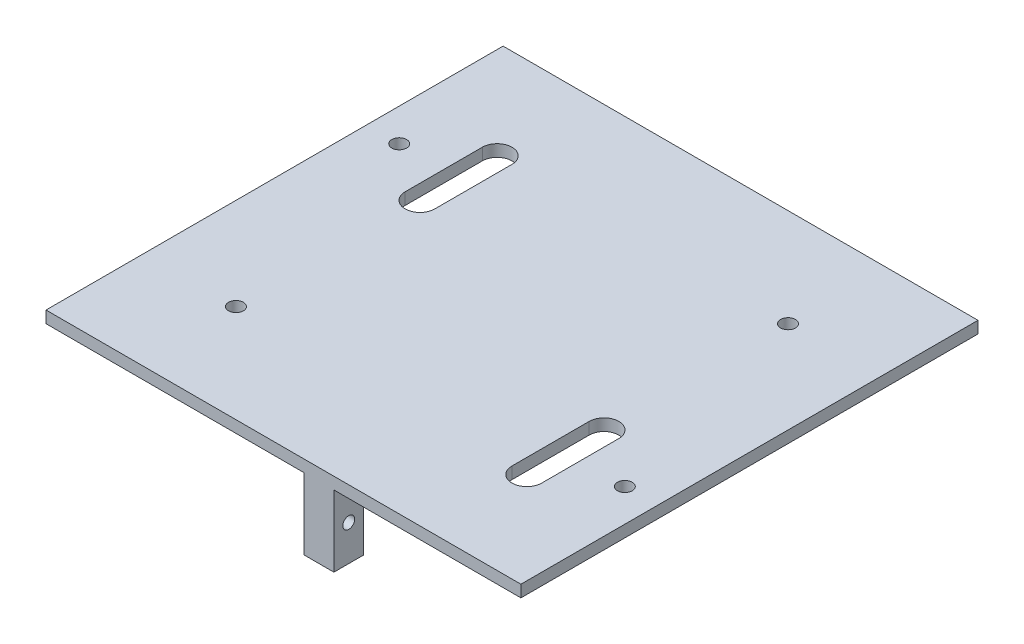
ISO-10303-21;
HEADER;
FILE_DESCRIPTION(('STEP AP214'),'2;1');
FILE_NAME('part.step','',(''),(''),'','','');
FILE_SCHEMA(('AUTOMOTIVE_DESIGN { 1 0 10303 214 1 1 1 1 }'));
ENDSEC;
DATA;
#1=APPLICATION_CONTEXT('core data for automotive mechanical design processes');
#2=APPLICATION_PROTOCOL_DEFINITION('international standard','automotive_design',2000,#1);
#3=PRODUCT_CONTEXT('',#1,'mechanical');
#4=PRODUCT('Part','Part','',(#3));
#5=PRODUCT_RELATED_PRODUCT_CATEGORY('part','',(#4));
#6=PRODUCT_DEFINITION_FORMATION('','',#4);
#7=PRODUCT_DEFINITION_CONTEXT('part definition',#1,'design');
#8=PRODUCT_DEFINITION('design','',#6,#7);
#9=PRODUCT_DEFINITION_SHAPE('','',#8);
#10=(LENGTH_UNIT() NAMED_UNIT(*) SI_UNIT(.MILLI.,.METRE.));
#11=(NAMED_UNIT(*) PLANE_ANGLE_UNIT() SI_UNIT($,.RADIAN.));
#12=(NAMED_UNIT(*) SI_UNIT($,.STERADIAN.) SOLID_ANGLE_UNIT());
#13=UNCERTAINTY_MEASURE_WITH_UNIT(LENGTH_MEASURE(1.E-05),#10,'distance_accuracy_value','');
#14=(GEOMETRIC_REPRESENTATION_CONTEXT(3) GLOBAL_UNCERTAINTY_ASSIGNED_CONTEXT((#13)) GLOBAL_UNIT_ASSIGNED_CONTEXT((#10,
#11,#12)) REPRESENTATION_CONTEXT('',''));
#15=CARTESIAN_POINT('',(0.,0.,0.));
#16=DIRECTION('',(0.,0.,1.));
#17=DIRECTION('',(1.,0.,0.));
#18=AXIS2_PLACEMENT_3D('',#15,#16,#17);
#19=CARTESIAN_POINT('',(0.,0.,0.));
#20=DIRECTION('',(0.,-1.,0.));
#21=DIRECTION('',(0.,0.,-1.));
#22=AXIS2_PLACEMENT_3D('',#19,#20,#21);
#23=PLANE('',#22);
#24=CARTESIAN_POINT('',(24.5,0.,-22.));
#25=DIRECTION('',(0.,-1.,0.));
#26=DIRECTION('',(0.,0.,-1.));
#27=AXIS2_PLACEMENT_3D('',#24,#25,#26);
#28=CIRCLE('',#27,1.25);
#29=CARTESIAN_POINT('',(24.5,0.,-23.25));
#30=VERTEX_POINT('',#29);
#31=EDGE_CURVE('E734',#30,#30,#28,.T.);
#32=ORIENTED_EDGE('',*,*,#31,.F.);
#33=EDGE_LOOP('',(#32));
#34=FACE_BOUND('',#33,.T.);
#35=CARTESIAN_POINT('',(-24.5,0.,22.));
#36=DIRECTION('',(0.,-1.,0.));
#37=DIRECTION('',(0.,0.,-1.));
#38=AXIS2_PLACEMENT_3D('',#35,#36,#37);
#39=CIRCLE('',#38,1.25);
#40=CARTESIAN_POINT('',(-24.5,0.,20.75));
#41=VERTEX_POINT('',#40);
#42=EDGE_CURVE('E743',#41,#41,#39,.T.);
#43=ORIENTED_EDGE('',*,*,#42,.F.);
#44=EDGE_LOOP('',(#43));
#45=FACE_BOUND('',#44,.T.);
#46=CARTESIAN_POINT('',(-34.5,0.,-15.5));
#47=DIRECTION('',(0.,-1.,0.));
#48=DIRECTION('',(0.,0.,-1.));
#49=AXIS2_PLACEMENT_3D('',#46,#47,#48);
#50=CIRCLE('',#49,1.25);
#51=CARTESIAN_POINT('',(-34.5,0.,-16.75));
#52=VERTEX_POINT('',#51);
#53=EDGE_CURVE('E749',#52,#52,#50,.T.);
#54=ORIENTED_EDGE('',*,*,#53,.F.);
#55=EDGE_LOOP('',(#54));
#56=FACE_BOUND('',#55,.T.);
#57=CARTESIAN_POINT('',(34.5,0.,15.5));
#58=DIRECTION('',(0.,-1.,0.));
#59=DIRECTION('',(0.,0.,-1.));
#60=AXIS2_PLACEMENT_3D('',#57,#58,#59);
#61=CIRCLE('',#60,1.25);
#62=CARTESIAN_POINT('',(34.5,0.,14.25));
#63=VERTEX_POINT('',#62);
#64=EDGE_CURVE('E740',#63,#63,#61,.T.);
#65=ORIENTED_EDGE('',*,*,#64,.F.);
#66=EDGE_LOOP('',(#65));
#67=FACE_BOUND('',#66,.T.);
#68=DIRECTION('',(0.,0.,1.));
#69=VECTOR('',#68,1.);
#70=CARTESIAN_POINT('',(3.5,0.,33.5));
#71=LINE('',#70,#69);
#72=CARTESIAN_POINT('',(3.5,0.,33.5));
#73=VERTEX_POINT('',#72);
#74=CARTESIAN_POINT('',(3.5,0.,38.5));
#75=VERTEX_POINT('',#74);
#76=EDGE_CURVE('E240',#73,#75,#71,.T.);
#77=ORIENTED_EDGE('',*,*,#76,.T.);
#78=DIRECTION('',(1.,0.,0.));
#79=VECTOR('',#78,1.);
#80=CARTESIAN_POINT('',(-40.,0.,38.5));
#81=LINE('',#80,#79);
#82=CARTESIAN_POINT('',(-40.,0.,38.5));
#83=VERTEX_POINT('',#82);
#84=EDGE_CURVE('E505',#83,#75,#81,.T.);
#85=ORIENTED_EDGE('',*,*,#84,.F.);
#86=DIRECTION('',(0.,0.,1.));
#87=VECTOR('',#86,1.);
#88=CARTESIAN_POINT('',(-40.,0.,-38.5));
#89=LINE('',#88,#87);
#90=CARTESIAN_POINT('',(-40.,0.,-38.5));
#91=VERTEX_POINT('',#90);
#92=EDGE_CURVE('E486',#91,#83,#89,.T.);
#93=ORIENTED_EDGE('',*,*,#92,.F.);
#94=DIRECTION('',(1.,0.,0.));
#95=VECTOR('',#94,1.);
#96=CARTESIAN_POINT('',(-40.,0.,-38.5));
#97=LINE('',#96,#95);
#98=CARTESIAN_POINT('',(-8.5,0.,-38.5));
#99=VERTEX_POINT('',#98);
#100=EDGE_CURVE('E497',#91,#99,#97,.T.);
#101=ORIENTED_EDGE('',*,*,#100,.T.);
#102=DIRECTION('',(0.,0.,1.));
#103=VECTOR('',#102,1.);
#104=CARTESIAN_POINT('',(-8.5,0.,-38.5));
#105=LINE('',#104,#103);
#106=CARTESIAN_POINT('',(-8.5,0.,-33.5));
#107=VERTEX_POINT('',#106);
#108=EDGE_CURVE('E340',#99,#107,#105,.T.);
#109=ORIENTED_EDGE('',*,*,#108,.T.);
#110=DIRECTION('',(1.,0.,0.));
#111=VECTOR('',#110,1.);
#112=CARTESIAN_POINT('',(-8.5,0.,-33.5));
#113=LINE('',#112,#111);
#114=CARTESIAN_POINT('',(-3.5,0.,-33.5));
#115=VERTEX_POINT('',#114);
#116=EDGE_CURVE('E371',#107,#115,#113,.T.);
#117=ORIENTED_EDGE('',*,*,#116,.T.);
#118=DIRECTION('',(0.,0.,1.));
#119=VECTOR('',#118,1.);
#120=CARTESIAN_POINT('',(-3.5,0.,-38.5));
#121=LINE('',#120,#119);
#122=CARTESIAN_POINT('',(-3.5,0.,-38.5));
#123=VERTEX_POINT('',#122);
#124=EDGE_CURVE('E358',#123,#115,#121,.T.);
#125=ORIENTED_EDGE('',*,*,#124,.F.);
#126=CARTESIAN_POINT('',(40.,0.,-38.5));
#127=VERTEX_POINT('',#126);
#128=EDGE_CURVE('E438',#123,#127,#97,.T.);
#129=ORIENTED_EDGE('',*,*,#128,.T.);
#130=DIRECTION('',(0.,0.,1.));
#131=VECTOR('',#130,1.);
#132=CARTESIAN_POINT('',(40.,0.,-38.5));
#133=LINE('',#132,#131);
#134=CARTESIAN_POINT('',(40.,0.,38.5));
#135=VERTEX_POINT('',#134);
#136=EDGE_CURVE('E500',#127,#135,#133,.T.);
#137=ORIENTED_EDGE('',*,*,#136,.T.);
#138=CARTESIAN_POINT('',(8.5,0.,38.5));
#139=VERTEX_POINT('',#138);
#140=EDGE_CURVE('E504',#139,#135,#81,.T.);
#141=ORIENTED_EDGE('',*,*,#140,.F.);
#142=DIRECTION('',(0.,0.,1.));
#143=VECTOR('',#142,1.);
#144=CARTESIAN_POINT('',(8.5,0.,33.5));
#145=LINE('',#144,#143);
#146=CARTESIAN_POINT('',(8.5,0.,33.5));
#147=VERTEX_POINT('',#146);
#148=EDGE_CURVE('E56',#147,#139,#145,.T.);
#149=ORIENTED_EDGE('',*,*,#148,.F.);
#150=DIRECTION('',(1.,0.,0.));
#151=VECTOR('',#150,1.);
#152=CARTESIAN_POINT('',(3.5,0.,33.5));
#153=LINE('',#152,#151);
#154=EDGE_CURVE('E231',#73,#147,#153,.T.);
#155=ORIENTED_EDGE('',*,*,#154,.F.);
#156=EDGE_LOOP('',(#77,#85,#93,#101,#109,#117,#125,#129,#137,#141,#149,#155));
#157=FACE_BOUND('',#156,.T.);
#158=DIRECTION('',(0.,0.,1.));
#159=VECTOR('',#158,1.);
#160=CARTESIAN_POINT('',(3.5,0.,5.));
#161=LINE('',#160,#159);
#162=CARTESIAN_POINT('',(3.5,0.,5.));
#163=VERTEX_POINT('',#162);
#164=CARTESIAN_POINT('',(3.5,0.,10.));
#165=VERTEX_POINT('',#164);
#166=EDGE_CURVE('E293',#163,#165,#161,.T.);
#167=ORIENTED_EDGE('',*,*,#166,.T.);
#168=DIRECTION('',(1.,0.,0.));
#169=VECTOR('',#168,1.);
#170=CARTESIAN_POINT('',(3.5,0.,10.));
#171=LINE('',#170,#169);
#172=CARTESIAN_POINT('',(8.5,0.,10.));
#173=VERTEX_POINT('',#172);
#174=EDGE_CURVE('E290',#165,#173,#171,.T.);
#175=ORIENTED_EDGE('',*,*,#174,.T.);
#176=DIRECTION('',(0.,0.,1.));
#177=VECTOR('',#176,1.);
#178=CARTESIAN_POINT('',(8.5,0.,5.));
#179=LINE('',#178,#177);
#180=CARTESIAN_POINT('',(8.5,0.,5.));
#181=VERTEX_POINT('',#180);
#182=EDGE_CURVE('E285',#181,#173,#179,.T.);
#183=ORIENTED_EDGE('',*,*,#182,.F.);
#184=DIRECTION('',(1.,0.,0.));
#185=VECTOR('',#184,1.);
#186=CARTESIAN_POINT('',(3.5,0.,5.));
#187=LINE('',#186,#185);
#188=EDGE_CURVE('E64',#163,#181,#187,.T.);
#189=ORIENTED_EDGE('',*,*,#188,.F.);
#190=EDGE_LOOP('',(#167,#175,#183,#189));
#191=FACE_BOUND('',#190,.T.);
#192=DIRECTION('',(0.,0.,1.));
#193=VECTOR('',#192,1.);
#194=CARTESIAN_POINT('',(-8.50000000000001,0.,-10.));
#195=LINE('',#194,#193);
#196=CARTESIAN_POINT('',(-8.50000000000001,0.,-10.));
#197=VERTEX_POINT('',#196);
#198=CARTESIAN_POINT('',(-8.50000000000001,0.,-5.));
#199=VERTEX_POINT('',#198);
#200=EDGE_CURVE('E337',#197,#199,#195,.T.);
#201=ORIENTED_EDGE('',*,*,#200,.T.);
#202=DIRECTION('',(1.,0.,0.));
#203=VECTOR('',#202,1.);
#204=CARTESIAN_POINT('',(-8.50000000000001,0.,-5.));
#205=LINE('',#204,#203);
#206=CARTESIAN_POINT('',(-3.50000000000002,0.,-5.));
#207=VERTEX_POINT('',#206);
#208=EDGE_CURVE('E334',#199,#207,#205,.T.);
#209=ORIENTED_EDGE('',*,*,#208,.T.);
#210=DIRECTION('',(0.,0.,1.));
#211=VECTOR('',#210,1.);
#212=CARTESIAN_POINT('',(-3.50000000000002,0.,-10.));
#213=LINE('',#212,#211);
#214=CARTESIAN_POINT('',(-3.50000000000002,0.,-10.));
#215=VERTEX_POINT('',#214);
#216=EDGE_CURVE('E329',#215,#207,#213,.T.);
#217=ORIENTED_EDGE('',*,*,#216,.F.);
#218=DIRECTION('',(1.,0.,0.));
#219=VECTOR('',#218,1.);
#220=CARTESIAN_POINT('',(-8.50000000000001,0.,-10.));
#221=LINE('',#220,#219);
#222=EDGE_CURVE('E325',#197,#215,#221,.T.);
#223=ORIENTED_EDGE('',*,*,#222,.F.);
#224=EDGE_LOOP('',(#201,#209,#217,#223));
#225=FACE_BOUND('',#224,.T.);
#226=DIRECTION('',(0.,0.,1.));
#227=VECTOR('',#226,1.);
#228=CARTESIAN_POINT('',(27.,0.,9.));
#229=LINE('',#228,#227);
#230=CARTESIAN_POINT('',(27.,0.,9.));
#231=VERTEX_POINT('',#230);
#232=CARTESIAN_POINT('',(27.,0.,22.));
#233=VERTEX_POINT('',#232);
#234=EDGE_CURVE('E453',#231,#233,#229,.T.);
#235=ORIENTED_EDGE('',*,*,#234,.F.);
#236=CARTESIAN_POINT('',(24.5,0.,9.));
#237=DIRECTION('',(0.,1.,0.));
#238=DIRECTION('',(0.,0.,1.));
#239=AXIS2_PLACEMENT_3D('',#236,#237,#238);
#240=CIRCLE('',#239,2.49999999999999);
#241=CARTESIAN_POINT('',(22.,0.,9.));
#242=VERTEX_POINT('',#241);
#243=EDGE_CURVE('E414',#231,#242,#240,.T.);
#244=ORIENTED_EDGE('',*,*,#243,.T.);
#245=DIRECTION('',(0.,0.,1.));
#246=VECTOR('',#245,1.);
#247=CARTESIAN_POINT('',(22.,0.,9.));
#248=LINE('',#247,#246);
#249=CARTESIAN_POINT('',(22.,0.,22.));
#250=VERTEX_POINT('',#249);
#251=EDGE_CURVE('E462',#242,#250,#248,.T.);
#252=ORIENTED_EDGE('',*,*,#251,.T.);
#253=CARTESIAN_POINT('',(24.5,0.,22.));
#254=DIRECTION('',(0.,1.,0.));
#255=DIRECTION('',(0.,0.,1.));
#256=AXIS2_PLACEMENT_3D('',#253,#254,#255);
#257=CIRCLE('',#256,2.49999999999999);
#258=EDGE_CURVE('E457',#250,#233,#257,.T.);
#259=ORIENTED_EDGE('',*,*,#258,.T.);
#260=EDGE_LOOP('',(#235,#244,#252,#259));
#261=FACE_BOUND('',#260,.T.);
#262=DIRECTION('',(0.,0.,-1.));
#263=VECTOR('',#262,1.);
#264=CARTESIAN_POINT('',(-27.,0.,-9.));
#265=LINE('',#264,#263);
#266=CARTESIAN_POINT('',(-27.,0.,-9.));
#267=VERTEX_POINT('',#266);
#268=CARTESIAN_POINT('',(-27.,0.,-22.));
#269=VERTEX_POINT('',#268);
#270=EDGE_CURVE('E397',#267,#269,#265,.T.);
#271=ORIENTED_EDGE('',*,*,#270,.F.);
#272=CARTESIAN_POINT('',(-24.5,0.,-9.));
#273=DIRECTION('',(0.,1.,0.));
#274=DIRECTION('',(0.,0.,1.));
#275=AXIS2_PLACEMENT_3D('',#272,#273,#274);
#276=CIRCLE('',#275,2.5);
#277=CARTESIAN_POINT('',(-22.,0.,-9.));
#278=VERTEX_POINT('',#277);
#279=EDGE_CURVE('E409',#267,#278,#276,.T.);
#280=ORIENTED_EDGE('',*,*,#279,.T.);
#281=DIRECTION('',(0.,0.,-1.));
#282=VECTOR('',#281,1.);
#283=CARTESIAN_POINT('',(-22.,0.,-9.));
#284=LINE('',#283,#282);
#285=CARTESIAN_POINT('',(-22.,0.,-22.));
#286=VERTEX_POINT('',#285);
#287=EDGE_CURVE('E413',#278,#286,#284,.T.);
#288=ORIENTED_EDGE('',*,*,#287,.T.);
#289=CARTESIAN_POINT('',(-24.5,0.,-22.));
#290=DIRECTION('',(0.,1.,0.));
#291=DIRECTION('',(0.,0.,1.));
#292=AXIS2_PLACEMENT_3D('',#289,#290,#291);
#293=CIRCLE('',#292,2.5);
#294=EDGE_CURVE('E418',#286,#269,#293,.T.);
#295=ORIENTED_EDGE('',*,*,#294,.T.);
#296=EDGE_LOOP('',(#271,#280,#288,#295));
#297=FACE_BOUND('',#296,.T.);
#298=ADVANCED_FACE('F38',(#34,#45,#56,#67,#157,#191,#225,#261,#297),#23,.T.);
#299=CARTESIAN_POINT('',(0.,2.,0.));
#300=DIRECTION('',(0.,-1.,0.));
#301=DIRECTION('',(0.,0.,-1.));
#302=AXIS2_PLACEMENT_3D('',#299,#300,#301);
#303=PLANE('',#302);
#304=CARTESIAN_POINT('',(24.5,2.,-22.));
#305=DIRECTION('',(0.,-1.,0.));
#306=DIRECTION('',(0.,0.,-1.));
#307=AXIS2_PLACEMENT_3D('',#304,#305,#306);
#308=CIRCLE('',#307,1.25);
#309=CARTESIAN_POINT('',(24.5,2.,-23.25));
#310=VERTEX_POINT('',#309);
#311=EDGE_CURVE('E732',#310,#310,#308,.F.);
#312=ORIENTED_EDGE('',*,*,#311,.F.);
#313=EDGE_LOOP('',(#312));
#314=FACE_BOUND('',#313,.T.);
#315=CARTESIAN_POINT('',(-24.5,2.,22.));
#316=DIRECTION('',(0.,-1.,0.));
#317=DIRECTION('',(0.,0.,-1.));
#318=AXIS2_PLACEMENT_3D('',#315,#316,#317);
#319=CIRCLE('',#318,1.25);
#320=CARTESIAN_POINT('',(-24.5,2.,20.75));
#321=VERTEX_POINT('',#320);
#322=EDGE_CURVE('E736',#321,#321,#319,.F.);
#323=ORIENTED_EDGE('',*,*,#322,.F.);
#324=EDGE_LOOP('',(#323));
#325=FACE_BOUND('',#324,.T.);
#326=CARTESIAN_POINT('',(-34.5,2.,-15.5));
#327=DIRECTION('',(0.,-1.,0.));
#328=DIRECTION('',(0.,0.,-1.));
#329=AXIS2_PLACEMENT_3D('',#326,#327,#328);
#330=CIRCLE('',#329,1.25);
#331=CARTESIAN_POINT('',(-34.5,2.,-16.75));
#332=VERTEX_POINT('',#331);
#333=EDGE_CURVE('E753',#332,#332,#330,.F.);
#334=ORIENTED_EDGE('',*,*,#333,.F.);
#335=EDGE_LOOP('',(#334));
#336=FACE_BOUND('',#335,.T.);
#337=CARTESIAN_POINT('',(34.5,2.,15.5));
#338=DIRECTION('',(0.,-1.,0.));
#339=DIRECTION('',(0.,0.,-1.));
#340=AXIS2_PLACEMENT_3D('',#337,#338,#339);
#341=CIRCLE('',#340,1.25);
#342=CARTESIAN_POINT('',(34.5,2.,14.25));
#343=VERTEX_POINT('',#342);
#344=EDGE_CURVE('E754',#343,#343,#341,.F.);
#345=ORIENTED_EDGE('',*,*,#344,.F.);
#346=EDGE_LOOP('',(#345));
#347=FACE_BOUND('',#346,.T.);
#348=CARTESIAN_POINT('',(24.5,2.,9.));
#349=DIRECTION('',(0.,1.,0.));
#350=DIRECTION('',(0.,0.,1.));
#351=AXIS2_PLACEMENT_3D('',#348,#349,#350);
#352=CIRCLE('',#351,2.49999999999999);
#353=CARTESIAN_POINT('',(27.,2.,9.));
#354=VERTEX_POINT('',#353);
#355=CARTESIAN_POINT('',(22.,2.,9.));
#356=VERTEX_POINT('',#355);
#357=EDGE_CURVE('E458',#354,#356,#352,.T.);
#358=ORIENTED_EDGE('',*,*,#357,.F.);
#359=DIRECTION('',(0.,0.,1.));
#360=VECTOR('',#359,1.);
#361=CARTESIAN_POINT('',(27.,2.,9.));
#362=LINE('',#361,#360);
#363=CARTESIAN_POINT('',(27.,2.,22.));
#364=VERTEX_POINT('',#363);
#365=EDGE_CURVE('E452',#354,#364,#362,.T.);
#366=ORIENTED_EDGE('',*,*,#365,.T.);
#367=CARTESIAN_POINT('',(24.5,2.,22.));
#368=DIRECTION('',(0.,1.,0.));
#369=DIRECTION('',(0.,0.,1.));
#370=AXIS2_PLACEMENT_3D('',#367,#368,#369);
#371=CIRCLE('',#370,2.49999999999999);
#372=CARTESIAN_POINT('',(22.,2.,22.));
#373=VERTEX_POINT('',#372);
#374=EDGE_CURVE('E472',#373,#364,#371,.T.);
#375=ORIENTED_EDGE('',*,*,#374,.F.);
#376=DIRECTION('',(0.,0.,1.));
#377=VECTOR('',#376,1.);
#378=CARTESIAN_POINT('',(22.,2.,9.));
#379=LINE('',#378,#377);
#380=EDGE_CURVE('E476',#356,#373,#379,.T.);
#381=ORIENTED_EDGE('',*,*,#380,.F.);
#382=EDGE_LOOP('',(#358,#366,#375,#381));
#383=FACE_BOUND('',#382,.T.);
#384=DIRECTION('',(1.,0.,0.));
#385=VECTOR('',#384,1.);
#386=CARTESIAN_POINT('',(-40.,2.,-38.5));
#387=LINE('',#386,#385);
#388=CARTESIAN_POINT('',(-40.,2.,-38.5));
#389=VERTEX_POINT('',#388);
#390=CARTESIAN_POINT('',(40.,2.,-38.5));
#391=VERTEX_POINT('',#390);
#392=EDGE_CURVE('E481',#389,#391,#387,.T.);
#393=ORIENTED_EDGE('',*,*,#392,.F.);
#394=DIRECTION('',(0.,0.,1.));
#395=VECTOR('',#394,1.);
#396=CARTESIAN_POINT('',(-40.,2.,-38.5));
#397=LINE('',#396,#395);
#398=CARTESIAN_POINT('',(-40.,2.,38.5));
#399=VERTEX_POINT('',#398);
#400=EDGE_CURVE('E493',#389,#399,#397,.T.);
#401=ORIENTED_EDGE('',*,*,#400,.T.);
#402=DIRECTION('',(1.,0.,0.));
#403=VECTOR('',#402,1.);
#404=CARTESIAN_POINT('',(-40.,2.,38.5));
#405=LINE('',#404,#403);
#406=CARTESIAN_POINT('',(40.,2.,38.5));
#407=VERTEX_POINT('',#406);
#408=EDGE_CURVE('E490',#399,#407,#405,.T.);
#409=ORIENTED_EDGE('',*,*,#408,.T.);
#410=DIRECTION('',(0.,0.,1.));
#411=VECTOR('',#410,1.);
#412=CARTESIAN_POINT('',(40.,2.,-38.5));
#413=LINE('',#412,#411);
#414=EDGE_CURVE('E485',#391,#407,#413,.T.);
#415=ORIENTED_EDGE('',*,*,#414,.F.);
#416=EDGE_LOOP('',(#393,#401,#409,#415));
#417=FACE_BOUND('',#416,.T.);
#418=CARTESIAN_POINT('',(-24.5,2.,-9.));
#419=DIRECTION('',(0.,1.,0.));
#420=DIRECTION('',(0.,0.,1.));
#421=AXIS2_PLACEMENT_3D('',#418,#419,#420);
#422=CIRCLE('',#421,2.5);
#423=CARTESIAN_POINT('',(-27.,2.,-9.));
#424=VERTEX_POINT('',#423);
#425=CARTESIAN_POINT('',(-22.,2.,-9.));
#426=VERTEX_POINT('',#425);
#427=EDGE_CURVE('E393',#424,#426,#422,.T.);
#428=ORIENTED_EDGE('',*,*,#427,.F.);
#429=DIRECTION('',(0.,0.,-1.));
#430=VECTOR('',#429,1.);
#431=CARTESIAN_POINT('',(-27.,2.,-9.));
#432=LINE('',#431,#430);
#433=CARTESIAN_POINT('',(-27.,2.,-22.));
#434=VERTEX_POINT('',#433);
#435=EDGE_CURVE('E404',#424,#434,#432,.T.);
#436=ORIENTED_EDGE('',*,*,#435,.T.);
#437=CARTESIAN_POINT('',(-24.5,2.,-22.));
#438=DIRECTION('',(0.,1.,0.));
#439=DIRECTION('',(0.,0.,1.));
#440=AXIS2_PLACEMENT_3D('',#437,#438,#439);
#441=CIRCLE('',#440,2.5);
#442=CARTESIAN_POINT('',(-22.,2.,-22.));
#443=VERTEX_POINT('',#442);
#444=EDGE_CURVE('E400',#443,#434,#441,.T.);
#445=ORIENTED_EDGE('',*,*,#444,.F.);
#446=DIRECTION('',(0.,0.,-1.));
#447=VECTOR('',#446,1.);
#448=CARTESIAN_POINT('',(-22.,2.,-9.));
#449=LINE('',#448,#447);
#450=EDGE_CURVE('E396',#426,#443,#449,.T.);
#451=ORIENTED_EDGE('',*,*,#450,.F.);
#452=EDGE_LOOP('',(#428,#436,#445,#451));
#453=FACE_BOUND('',#452,.T.);
#454=ADVANCED_FACE('F582',(#314,#325,#336,#347,#383,#417,#453),#303,.F.);
#455=CARTESIAN_POINT('',(-40.,2.,-38.5));
#456=DIRECTION('',(0.,0.,-1.));
#457=DIRECTION('',(-1.,0.,0.));
#458=AXIS2_PLACEMENT_3D('',#455,#456,#457);
#459=PLANE('',#458);
#460=ORIENTED_EDGE('',*,*,#100,.F.);
#461=DIRECTION('',(0.,-1.,0.));
#462=VECTOR('',#461,1.);
#463=CARTESIAN_POINT('',(-40.,2.,-38.5));
#464=LINE('',#463,#462);
#465=EDGE_CURVE('E11',#389,#91,#464,.T.);
#466=ORIENTED_EDGE('',*,*,#465,.F.);
#467=ORIENTED_EDGE('',*,*,#392,.T.);
#468=DIRECTION('',(0.,-1.,0.));
#469=VECTOR('',#468,1.);
#470=CARTESIAN_POINT('',(40.,2.,-38.5));
#471=LINE('',#470,#469);
#472=EDGE_CURVE('E496',#391,#127,#471,.T.);
#473=ORIENTED_EDGE('',*,*,#472,.T.);
#474=ORIENTED_EDGE('',*,*,#128,.F.);
#475=DIRECTION('',(0.,1.,0.));
#476=VECTOR('',#475,1.);
#477=CARTESIAN_POINT('',(-3.5,-12.,-38.5));
#478=LINE('',#477,#476);
#479=CARTESIAN_POINT('',(-3.5,-12.,-38.5));
#480=VERTEX_POINT('',#479);
#481=EDGE_CURVE('E382',#480,#123,#478,.T.);
#482=ORIENTED_EDGE('',*,*,#481,.F.);
#483=DIRECTION('',(1.,0.,0.));
#484=VECTOR('',#483,1.);
#485=CARTESIAN_POINT('',(-8.5,-12.,-38.5));
#486=LINE('',#485,#484);
#487=CARTESIAN_POINT('',(-8.5,-12.,-38.5));
#488=VERTEX_POINT('',#487);
#489=EDGE_CURVE('E365',#488,#480,#486,.T.);
#490=ORIENTED_EDGE('',*,*,#489,.F.);
#491=DIRECTION('',(0.,1.,0.));
#492=VECTOR('',#491,1.);
#493=CARTESIAN_POINT('',(-8.5,-12.,-38.5));
#494=LINE('',#493,#492);
#495=EDGE_CURVE('E377',#488,#99,#494,.T.);
#496=ORIENTED_EDGE('',*,*,#495,.T.);
#497=EDGE_LOOP('',(#460,#466,#467,#473,#474,#482,#490,#496));
#498=FACE_BOUND('',#497,.T.);
#499=ADVANCED_FACE('F40',(#498),#459,.T.);
#500=CARTESIAN_POINT('',(-40.,2.,-38.5));
#501=DIRECTION('',(1.,0.,0.));
#502=DIRECTION('',(0.,0.,-1.));
#503=AXIS2_PLACEMENT_3D('',#500,#501,#502);
#504=PLANE('',#503);
#505=ORIENTED_EDGE('',*,*,#92,.T.);
#506=DIRECTION('',(0.,-1.,0.));
#507=VECTOR('',#506,1.);
#508=CARTESIAN_POINT('',(-40.,2.,38.5));
#509=LINE('',#508,#507);
#510=EDGE_CURVE('E48',#399,#83,#509,.T.);
#511=ORIENTED_EDGE('',*,*,#510,.F.);
#512=ORIENTED_EDGE('',*,*,#400,.F.);
#513=ORIENTED_EDGE('',*,*,#465,.T.);
#514=EDGE_LOOP('',(#505,#511,#512,#513));
#515=FACE_BOUND('',#514,.T.);
#516=ADVANCED_FACE('F584',(#515),#504,.F.);
#517=CARTESIAN_POINT('',(-40.,2.,38.5));
#518=DIRECTION('',(0.,0.,-1.));
#519=DIRECTION('',(-1.,0.,0.));
#520=AXIS2_PLACEMENT_3D('',#517,#518,#519);
#521=PLANE('',#520);
#522=ORIENTED_EDGE('',*,*,#84,.T.);
#523=DIRECTION('',(0.,1.,0.));
#524=VECTOR('',#523,1.);
#525=CARTESIAN_POINT('',(3.5,-12.,38.5));
#526=LINE('',#525,#524);
#527=CARTESIAN_POINT('',(3.5,-12.,38.5));
#528=VERTEX_POINT('',#527);
#529=EDGE_CURVE('E242',#528,#75,#526,.T.);
#530=ORIENTED_EDGE('',*,*,#529,.F.);
#531=DIRECTION('',(1.,0.,0.));
#532=VECTOR('',#531,1.);
#533=CARTESIAN_POINT('',(3.5,-12.,38.5));
#534=LINE('',#533,#532);
#535=CARTESIAN_POINT('',(8.5,-12.,38.5));
#536=VERTEX_POINT('',#535);
#537=EDGE_CURVE('E256',#528,#536,#534,.T.);
#538=ORIENTED_EDGE('',*,*,#537,.T.);
#539=DIRECTION('',(0.,1.,0.));
#540=VECTOR('',#539,1.);
#541=CARTESIAN_POINT('',(8.5,-12.,38.5));
#542=LINE('',#541,#540);
#543=EDGE_CURVE('E541',#536,#139,#542,.T.);
#544=ORIENTED_EDGE('',*,*,#543,.T.);
#545=ORIENTED_EDGE('',*,*,#140,.T.);
#546=DIRECTION('',(0.,-1.,0.));
#547=VECTOR('',#546,1.);
#548=CARTESIAN_POINT('',(40.,2.,38.5));
#549=LINE('',#548,#547);
#550=EDGE_CURVE('E513',#407,#135,#549,.T.);
#551=ORIENTED_EDGE('',*,*,#550,.F.);
#552=ORIENTED_EDGE('',*,*,#408,.F.);
#553=ORIENTED_EDGE('',*,*,#510,.T.);
#554=EDGE_LOOP('',(#522,#530,#538,#544,#545,#551,#552,#553));
#555=FACE_BOUND('',#554,.T.);
#556=ADVANCED_FACE('F550',(#555),#521,.F.);
#557=CARTESIAN_POINT('',(40.,2.,-38.5));
#558=DIRECTION('',(1.,0.,0.));
#559=DIRECTION('',(0.,0.,-1.));
#560=AXIS2_PLACEMENT_3D('',#557,#558,#559);
#561=PLANE('',#560);
#562=ORIENTED_EDGE('',*,*,#136,.F.);
#563=ORIENTED_EDGE('',*,*,#472,.F.);
#564=ORIENTED_EDGE('',*,*,#414,.T.);
#565=ORIENTED_EDGE('',*,*,#550,.T.);
#566=EDGE_LOOP('',(#562,#563,#564,#565));
#567=FACE_BOUND('',#566,.T.);
#568=ADVANCED_FACE('F578',(#567),#561,.T.);
#569=CARTESIAN_POINT('',(24.5,2.,9.));
#570=DIRECTION('',(0.,-1.,0.));
#571=DIRECTION('',(0.,0.,-1.));
#572=AXIS2_PLACEMENT_3D('',#569,#570,#571);
#573=CYLINDRICAL_SURFACE('',#572,2.49999999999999);
#574=ORIENTED_EDGE('',*,*,#243,.F.);
#575=DIRECTION('',(0.,-1.,0.));
#576=VECTOR('',#575,1.);
#577=CARTESIAN_POINT('',(27.,2.,9.));
#578=LINE('',#577,#576);
#579=EDGE_CURVE('E448',#354,#231,#578,.T.);
#580=ORIENTED_EDGE('',*,*,#579,.F.);
#581=ORIENTED_EDGE('',*,*,#357,.T.);
#582=DIRECTION('',(0.,-1.,0.));
#583=VECTOR('',#582,1.);
#584=CARTESIAN_POINT('',(22.,2.,9.));
#585=LINE('',#584,#583);
#586=EDGE_CURVE('E381',#356,#242,#585,.T.);
#587=ORIENTED_EDGE('',*,*,#586,.T.);
#588=EDGE_LOOP('',(#574,#580,#581,#587));
#589=FACE_BOUND('',#588,.T.);
#590=ADVANCED_FACE('F616',(#589),#573,.F.);
#591=CARTESIAN_POINT('',(22.,2.,9.));
#592=DIRECTION('',(1.,0.,0.));
#593=DIRECTION('',(0.,0.,-1.));
#594=AXIS2_PLACEMENT_3D('',#591,#592,#593);
#595=PLANE('',#594);
#596=ORIENTED_EDGE('',*,*,#251,.F.);
#597=ORIENTED_EDGE('',*,*,#586,.F.);
#598=ORIENTED_EDGE('',*,*,#380,.T.);
#599=DIRECTION('',(0.,-1.,0.));
#600=VECTOR('',#599,1.);
#601=CARTESIAN_POINT('',(22.,2.,22.));
#602=LINE('',#601,#600);
#603=EDGE_CURVE('E442',#373,#250,#602,.T.);
#604=ORIENTED_EDGE('',*,*,#603,.T.);
#605=EDGE_LOOP('',(#596,#597,#598,#604));
#606=FACE_BOUND('',#605,.T.);
#607=ADVANCED_FACE('F612',(#606),#595,.T.);
#608=CARTESIAN_POINT('',(24.5,2.,22.));
#609=DIRECTION('',(0.,-1.,0.));
#610=DIRECTION('',(0.,0.,-1.));
#611=AXIS2_PLACEMENT_3D('',#608,#609,#610);
#612=CYLINDRICAL_SURFACE('',#611,2.49999999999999);
#613=ORIENTED_EDGE('',*,*,#258,.F.);
#614=ORIENTED_EDGE('',*,*,#603,.F.);
#615=ORIENTED_EDGE('',*,*,#374,.T.);
#616=DIRECTION('',(0.,-1.,0.));
#617=VECTOR('',#616,1.);
#618=CARTESIAN_POINT('',(27.,2.,22.));
#619=LINE('',#618,#617);
#620=EDGE_CURVE('E445',#364,#233,#619,.T.);
#621=ORIENTED_EDGE('',*,*,#620,.T.);
#622=EDGE_LOOP('',(#613,#614,#615,#621));
#623=FACE_BOUND('',#622,.T.);
#624=ADVANCED_FACE('F608',(#623),#612,.F.);
#625=CARTESIAN_POINT('',(27.,2.,9.));
#626=DIRECTION('',(1.,0.,0.));
#627=DIRECTION('',(0.,0.,-1.));
#628=AXIS2_PLACEMENT_3D('',#625,#626,#627);
#629=PLANE('',#628);
#630=ORIENTED_EDGE('',*,*,#234,.T.);
#631=ORIENTED_EDGE('',*,*,#620,.F.);
#632=ORIENTED_EDGE('',*,*,#365,.F.);
#633=ORIENTED_EDGE('',*,*,#579,.T.);
#634=EDGE_LOOP('',(#630,#631,#632,#633));
#635=FACE_BOUND('',#634,.T.);
#636=ADVANCED_FACE('F604',(#635),#629,.F.);
#637=CARTESIAN_POINT('',(-24.5,2.,-9.));
#638=DIRECTION('',(0.,-1.,0.));
#639=DIRECTION('',(0.,0.,-1.));
#640=AXIS2_PLACEMENT_3D('',#637,#638,#639);
#641=CYLINDRICAL_SURFACE('',#640,2.5);
#642=ORIENTED_EDGE('',*,*,#279,.F.);
#643=DIRECTION('',(0.,-1.,0.));
#644=VECTOR('',#643,1.);
#645=CARTESIAN_POINT('',(-27.,2.,-9.));
#646=LINE('',#645,#644);
#647=EDGE_CURVE('E408',#424,#267,#646,.T.);
#648=ORIENTED_EDGE('',*,*,#647,.F.);
#649=ORIENTED_EDGE('',*,*,#427,.T.);
#650=DIRECTION('',(0.,-1.,0.));
#651=VECTOR('',#650,1.);
#652=CARTESIAN_POINT('',(-22.,2.,-9.));
#653=LINE('',#652,#651);
#654=EDGE_CURVE('E434',#426,#278,#653,.T.);
#655=ORIENTED_EDGE('',*,*,#654,.T.);
#656=EDGE_LOOP('',(#642,#648,#649,#655));
#657=FACE_BOUND('',#656,.T.);
#658=ADVANCED_FACE('F607',(#657),#641,.F.);
#659=CARTESIAN_POINT('',(-22.,2.,-9.));
#660=DIRECTION('',(-1.,0.,0.));
#661=DIRECTION('',(0.,0.,1.));
#662=AXIS2_PLACEMENT_3D('',#659,#660,#661);
#663=PLANE('',#662);
#664=ORIENTED_EDGE('',*,*,#287,.F.);
#665=ORIENTED_EDGE('',*,*,#654,.F.);
#666=ORIENTED_EDGE('',*,*,#450,.T.);
#667=DIRECTION('',(0.,-1.,0.));
#668=VECTOR('',#667,1.);
#669=CARTESIAN_POINT('',(-22.,2.,-22.));
#670=LINE('',#669,#668);
#671=EDGE_CURVE('E431',#443,#286,#670,.T.);
#672=ORIENTED_EDGE('',*,*,#671,.T.);
#673=EDGE_LOOP('',(#664,#665,#666,#672));
#674=FACE_BOUND('',#673,.T.);
#675=ADVANCED_FACE('F623',(#674),#663,.T.);
#676=CARTESIAN_POINT('',(-24.5,2.,-22.));
#677=DIRECTION('',(0.,-1.,0.));
#678=DIRECTION('',(0.,0.,-1.));
#679=AXIS2_PLACEMENT_3D('',#676,#677,#678);
#680=CYLINDRICAL_SURFACE('',#679,2.5);
#681=ORIENTED_EDGE('',*,*,#294,.F.);
#682=ORIENTED_EDGE('',*,*,#671,.F.);
#683=ORIENTED_EDGE('',*,*,#444,.T.);
#684=DIRECTION('',(0.,-1.,0.));
#685=VECTOR('',#684,1.);
#686=CARTESIAN_POINT('',(-27.,2.,-22.));
#687=LINE('',#686,#685);
#688=EDGE_CURVE('E428',#434,#269,#687,.T.);
#689=ORIENTED_EDGE('',*,*,#688,.T.);
#690=EDGE_LOOP('',(#681,#682,#683,#689));
#691=FACE_BOUND('',#690,.T.);
#692=ADVANCED_FACE('F627',(#691),#680,.F.);
#693=CARTESIAN_POINT('',(-27.,2.,-9.));
#694=DIRECTION('',(-1.,0.,0.));
#695=DIRECTION('',(0.,0.,1.));
#696=AXIS2_PLACEMENT_3D('',#693,#694,#695);
#697=PLANE('',#696);
#698=ORIENTED_EDGE('',*,*,#270,.T.);
#699=ORIENTED_EDGE('',*,*,#688,.F.);
#700=ORIENTED_EDGE('',*,*,#435,.F.);
#701=ORIENTED_EDGE('',*,*,#647,.T.);
#702=EDGE_LOOP('',(#698,#699,#700,#701));
#703=FACE_BOUND('',#702,.T.);
#704=ADVANCED_FACE('F631',(#703),#697,.F.);
#705=CARTESIAN_POINT('',(-8.5,-12.,-38.5));
#706=DIRECTION('',(-1.,0.,0.));
#707=DIRECTION('',(0.,0.,1.));
#708=AXIS2_PLACEMENT_3D('',#705,#706,#707);
#709=PLANE('',#708);
#710=CARTESIAN_POINT('',(-8.50000000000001,-6.,-36.));
#711=DIRECTION('',(-1.,0.,0.));
#712=DIRECTION('',(0.,0.,1.));
#713=AXIS2_PLACEMENT_3D('',#710,#711,#712);
#714=CIRCLE('',#713,0.999999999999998);
#715=CARTESIAN_POINT('',(-8.50000000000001,-6.,-35.));
#716=VERTEX_POINT('',#715);
#717=EDGE_CURVE('E769',#716,#716,#714,.T.);
#718=ORIENTED_EDGE('',*,*,#717,.F.);
#719=EDGE_LOOP('',(#718));
#720=FACE_BOUND('',#719,.T.);
#721=ORIENTED_EDGE('',*,*,#108,.F.);
#722=ORIENTED_EDGE('',*,*,#495,.F.);
#723=DIRECTION('',(0.,0.,1.));
#724=VECTOR('',#723,1.);
#725=CARTESIAN_POINT('',(-8.5,-12.,-38.5));
#726=LINE('',#725,#724);
#727=CARTESIAN_POINT('',(-8.5,-12.,-33.5));
#728=VERTEX_POINT('',#727);
#729=EDGE_CURVE('E353',#488,#728,#726,.T.);
#730=ORIENTED_EDGE('',*,*,#729,.T.);
#731=DIRECTION('',(0.,1.,0.));
#732=VECTOR('',#731,1.);
#733=CARTESIAN_POINT('',(-8.5,-12.,-33.5));
#734=LINE('',#733,#732);
#735=EDGE_CURVE('E368',#728,#107,#734,.T.);
#736=ORIENTED_EDGE('',*,*,#735,.T.);
#737=EDGE_LOOP('',(#721,#722,#730,#736));
#738=FACE_BOUND('',#737,.T.);
#739=ADVANCED_FACE('F563',(#720,#738),#709,.T.);
#740=CARTESIAN_POINT('',(-3.5,-12.,-38.5));
#741=DIRECTION('',(-1.,0.,0.));
#742=DIRECTION('',(0.,0.,1.));
#743=AXIS2_PLACEMENT_3D('',#740,#741,#742);
#744=PLANE('',#743);
#745=CARTESIAN_POINT('',(-3.5,-6.,-36.));
#746=DIRECTION('',(-1.,0.,0.));
#747=DIRECTION('',(0.,0.,1.));
#748=AXIS2_PLACEMENT_3D('',#745,#746,#747);
#749=CIRCLE('',#748,0.999999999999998);
#750=CARTESIAN_POINT('',(-3.5,-6.,-35.));
#751=VERTEX_POINT('',#750);
#752=EDGE_CURVE('E42',#751,#751,#749,.T.);
#753=ORIENTED_EDGE('',*,*,#752,.T.);
#754=EDGE_LOOP('',(#753));
#755=FACE_BOUND('',#754,.T.);
#756=ORIENTED_EDGE('',*,*,#124,.T.);
#757=DIRECTION('',(0.,1.,0.));
#758=VECTOR('',#757,1.);
#759=CARTESIAN_POINT('',(-3.5,-12.,-33.5));
#760=LINE('',#759,#758);
#761=CARTESIAN_POINT('',(-3.5,-12.,-33.5));
#762=VERTEX_POINT('',#761);
#763=EDGE_CURVE('E386',#762,#115,#760,.T.);
#764=ORIENTED_EDGE('',*,*,#763,.F.);
#765=DIRECTION('',(0.,0.,1.));
#766=VECTOR('',#765,1.);
#767=CARTESIAN_POINT('',(-3.5,-12.,-38.5));
#768=LINE('',#767,#766);
#769=EDGE_CURVE('E362',#480,#762,#768,.T.);
#770=ORIENTED_EDGE('',*,*,#769,.F.);
#771=ORIENTED_EDGE('',*,*,#481,.T.);
#772=EDGE_LOOP('',(#756,#764,#770,#771));
#773=FACE_BOUND('',#772,.T.);
#774=ADVANCED_FACE('F572',(#755,#773),#744,.F.);
#775=CARTESIAN_POINT('',(-8.5,-12.,-33.5));
#776=DIRECTION('',(0.,0.,1.));
#777=DIRECTION('',(1.,0.,0.));
#778=AXIS2_PLACEMENT_3D('',#775,#776,#777);
#779=PLANE('',#778);
#780=ORIENTED_EDGE('',*,*,#116,.F.);
#781=ORIENTED_EDGE('',*,*,#735,.F.);
#782=DIRECTION('',(1.,0.,0.));
#783=VECTOR('',#782,1.);
#784=CARTESIAN_POINT('',(-8.5,-12.,-33.5));
#785=LINE('',#784,#783);
#786=EDGE_CURVE('E357',#728,#762,#785,.T.);
#787=ORIENTED_EDGE('',*,*,#786,.T.);
#788=ORIENTED_EDGE('',*,*,#763,.T.);
#789=EDGE_LOOP('',(#780,#781,#787,#788));
#790=FACE_BOUND('',#789,.T.);
#791=ADVANCED_FACE('F568',(#790),#779,.T.);
#792=CARTESIAN_POINT('',(0.,-12.,0.));
#793=DIRECTION('',(0.,1.,0.));
#794=DIRECTION('',(0.,0.,1.));
#795=AXIS2_PLACEMENT_3D('',#792,#793,#794);
#796=PLANE('',#795);
#797=ORIENTED_EDGE('',*,*,#729,.F.);
#798=ORIENTED_EDGE('',*,*,#489,.T.);
#799=ORIENTED_EDGE('',*,*,#769,.T.);
#800=ORIENTED_EDGE('',*,*,#786,.F.);
#801=EDGE_LOOP('',(#797,#798,#799,#800));
#802=FACE_BOUND('',#801,.T.);
#803=ADVANCED_FACE('F641',(#802),#796,.F.);
#804=CARTESIAN_POINT('',(-8.50000000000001,-12.,-10.));
#805=DIRECTION('',(-1.,0.,0.));
#806=DIRECTION('',(0.,0.,1.));
#807=AXIS2_PLACEMENT_3D('',#804,#805,#806);
#808=PLANE('',#807);
#809=CARTESIAN_POINT('',(-8.50000000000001,-6.,-7.5));
#810=DIRECTION('',(-1.,0.,0.));
#811=DIRECTION('',(0.,0.,1.));
#812=AXIS2_PLACEMENT_3D('',#809,#810,#811);
#813=CIRCLE('',#812,1.);
#814=CARTESIAN_POINT('',(-8.50000000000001,-6.,-6.5));
#815=VERTEX_POINT('',#814);
#816=EDGE_CURVE('E535',#815,#815,#813,.T.);
#817=ORIENTED_EDGE('',*,*,#816,.F.);
#818=EDGE_LOOP('',(#817));
#819=FACE_BOUND('',#818,.T.);
#820=ORIENTED_EDGE('',*,*,#200,.F.);
#821=DIRECTION('',(0.,1.,0.));
#822=VECTOR('',#821,1.);
#823=CARTESIAN_POINT('',(-8.50000000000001,-12.,-10.));
#824=LINE('',#823,#822);
#825=CARTESIAN_POINT('',(-8.50000000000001,-12.,-10.));
#826=VERTEX_POINT('',#825);
#827=EDGE_CURVE('E296',#826,#197,#824,.T.);
#828=ORIENTED_EDGE('',*,*,#827,.F.);
#829=DIRECTION('',(0.,0.,1.));
#830=VECTOR('',#829,1.);
#831=CARTESIAN_POINT('',(-8.50000000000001,-12.,-10.));
#832=LINE('',#831,#830);
#833=CARTESIAN_POINT('',(-8.50000000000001,-12.,-5.));
#834=VERTEX_POINT('',#833);
#835=EDGE_CURVE('E330',#826,#834,#832,.T.);
#836=ORIENTED_EDGE('',*,*,#835,.T.);
#837=DIRECTION('',(0.,1.,0.));
#838=VECTOR('',#837,1.);
#839=CARTESIAN_POINT('',(-8.50000000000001,-12.,-5.));
#840=LINE('',#839,#838);
#841=EDGE_CURVE('E309',#834,#199,#840,.T.);
#842=ORIENTED_EDGE('',*,*,#841,.T.);
#843=EDGE_LOOP('',(#820,#828,#836,#842));
#844=FACE_BOUND('',#843,.T.);
#845=ADVANCED_FACE('F647',(#819,#844),#808,.T.);
#846=CARTESIAN_POINT('',(-8.50000000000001,-12.,-10.));
#847=DIRECTION('',(0.,0.,1.));
#848=DIRECTION('',(1.,0.,0.));
#849=AXIS2_PLACEMENT_3D('',#846,#847,#848);
#850=PLANE('',#849);
#851=ORIENTED_EDGE('',*,*,#222,.T.);
#852=DIRECTION('',(0.,1.,0.));
#853=VECTOR('',#852,1.);
#854=CARTESIAN_POINT('',(-3.50000000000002,-12.,-10.));
#855=LINE('',#854,#853);
#856=CARTESIAN_POINT('',(-3.50000000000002,-12.,-10.));
#857=VERTEX_POINT('',#856);
#858=EDGE_CURVE('E318',#857,#215,#855,.T.);
#859=ORIENTED_EDGE('',*,*,#858,.F.);
#860=DIRECTION('',(1.,0.,0.));
#861=VECTOR('',#860,1.);
#862=CARTESIAN_POINT('',(-8.50000000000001,-12.,-10.));
#863=LINE('',#862,#861);
#864=EDGE_CURVE('E313',#826,#857,#863,.T.);
#865=ORIENTED_EDGE('',*,*,#864,.F.);
#866=ORIENTED_EDGE('',*,*,#827,.T.);
#867=EDGE_LOOP('',(#851,#859,#865,#866));
#868=FACE_BOUND('',#867,.T.);
#869=ADVANCED_FACE('F655',(#868),#850,.F.);
#870=CARTESIAN_POINT('',(-3.50000000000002,-12.,-10.));
#871=DIRECTION('',(-1.,0.,0.));
#872=DIRECTION('',(0.,0.,1.));
#873=AXIS2_PLACEMENT_3D('',#870,#871,#872);
#874=PLANE('',#873);
#875=CARTESIAN_POINT('',(-3.50000000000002,-6.,-7.5));
#876=DIRECTION('',(-1.,0.,0.));
#877=DIRECTION('',(0.,0.,1.));
#878=AXIS2_PLACEMENT_3D('',#875,#876,#877);
#879=CIRCLE('',#878,1.);
#880=CARTESIAN_POINT('',(-3.50000000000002,-6.,-6.5));
#881=VERTEX_POINT('',#880);
#882=EDGE_CURVE('E519',#881,#881,#879,.T.);
#883=ORIENTED_EDGE('',*,*,#882,.T.);
#884=EDGE_LOOP('',(#883));
#885=FACE_BOUND('',#884,.T.);
#886=ORIENTED_EDGE('',*,*,#216,.T.);
#887=DIRECTION('',(0.,1.,0.));
#888=VECTOR('',#887,1.);
#889=CARTESIAN_POINT('',(-3.50000000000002,-12.,-5.));
#890=LINE('',#889,#888);
#891=CARTESIAN_POINT('',(-3.50000000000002,-12.,-5.));
#892=VERTEX_POINT('',#891);
#893=EDGE_CURVE('E314',#892,#207,#890,.T.);
#894=ORIENTED_EDGE('',*,*,#893,.F.);
#895=DIRECTION('',(0.,0.,1.));
#896=VECTOR('',#895,1.);
#897=CARTESIAN_POINT('',(-3.50000000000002,-12.,-10.));
#898=LINE('',#897,#896);
#899=EDGE_CURVE('E343',#857,#892,#898,.T.);
#900=ORIENTED_EDGE('',*,*,#899,.F.);
#901=ORIENTED_EDGE('',*,*,#858,.T.);
#902=EDGE_LOOP('',(#886,#894,#900,#901));
#903=FACE_BOUND('',#902,.T.);
#904=ADVANCED_FACE('F658',(#885,#903),#874,.F.);
#905=CARTESIAN_POINT('',(-8.50000000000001,-12.,-5.));
#906=DIRECTION('',(0.,0.,1.));
#907=DIRECTION('',(1.,0.,0.));
#908=AXIS2_PLACEMENT_3D('',#905,#906,#907);
#909=PLANE('',#908);
#910=ORIENTED_EDGE('',*,*,#208,.F.);
#911=ORIENTED_EDGE('',*,*,#841,.F.);
#912=DIRECTION('',(1.,0.,0.));
#913=VECTOR('',#912,1.);
#914=CARTESIAN_POINT('',(-8.50000000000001,-12.,-5.));
#915=LINE('',#914,#913);
#916=EDGE_CURVE('E346',#834,#892,#915,.T.);
#917=ORIENTED_EDGE('',*,*,#916,.T.);
#918=ORIENTED_EDGE('',*,*,#893,.T.);
#919=EDGE_LOOP('',(#910,#911,#917,#918));
#920=FACE_BOUND('',#919,.T.);
#921=ADVANCED_FACE('F653',(#920),#909,.T.);
#922=CARTESIAN_POINT('',(0.,-12.,0.));
#923=DIRECTION('',(0.,1.,0.));
#924=DIRECTION('',(0.,0.,1.));
#925=AXIS2_PLACEMENT_3D('',#922,#923,#924);
#926=PLANE('',#925);
#927=ORIENTED_EDGE('',*,*,#835,.F.);
#928=ORIENTED_EDGE('',*,*,#864,.T.);
#929=ORIENTED_EDGE('',*,*,#899,.T.);
#930=ORIENTED_EDGE('',*,*,#916,.F.);
#931=EDGE_LOOP('',(#927,#928,#929,#930));
#932=FACE_BOUND('',#931,.T.);
#933=ADVANCED_FACE('F649',(#932),#926,.F.);
#934=CARTESIAN_POINT('',(3.5,-12.,5.));
#935=DIRECTION('',(-1.,0.,0.));
#936=DIRECTION('',(0.,0.,1.));
#937=AXIS2_PLACEMENT_3D('',#934,#935,#936);
#938=PLANE('',#937);
#939=CARTESIAN_POINT('',(3.5,-6.,7.5));
#940=DIRECTION('',(-1.,0.,0.));
#941=DIRECTION('',(0.,0.,1.));
#942=AXIS2_PLACEMENT_3D('',#939,#940,#941);
#943=CIRCLE('',#942,1.);
#944=CARTESIAN_POINT('',(3.5,-6.,8.5));
#945=VERTEX_POINT('',#944);
#946=EDGE_CURVE('E522',#945,#945,#943,.T.);
#947=ORIENTED_EDGE('',*,*,#946,.F.);
#948=EDGE_LOOP('',(#947));
#949=FACE_BOUND('',#948,.T.);
#950=ORIENTED_EDGE('',*,*,#166,.F.);
#951=DIRECTION('',(0.,1.,0.));
#952=VECTOR('',#951,1.);
#953=CARTESIAN_POINT('',(3.5,-12.,5.));
#954=LINE('',#953,#952);
#955=CARTESIAN_POINT('',(3.5,-12.,5.));
#956=VERTEX_POINT('',#955);
#957=EDGE_CURVE('E247',#956,#163,#954,.T.);
#958=ORIENTED_EDGE('',*,*,#957,.F.);
#959=DIRECTION('',(0.,0.,1.));
#960=VECTOR('',#959,1.);
#961=CARTESIAN_POINT('',(3.5,-12.,5.));
#962=LINE('',#961,#960);
#963=CARTESIAN_POINT('',(3.5,-12.,10.));
#964=VERTEX_POINT('',#963);
#965=EDGE_CURVE('E286',#956,#964,#962,.T.);
#966=ORIENTED_EDGE('',*,*,#965,.T.);
#967=DIRECTION('',(0.,1.,0.));
#968=VECTOR('',#967,1.);
#969=CARTESIAN_POINT('',(3.5,-12.,10.));
#970=LINE('',#969,#968);
#971=EDGE_CURVE('E268',#964,#165,#970,.T.);
#972=ORIENTED_EDGE('',*,*,#971,.T.);
#973=EDGE_LOOP('',(#950,#958,#966,#972));
#974=FACE_BOUND('',#973,.T.);
#975=ADVANCED_FACE('F652',(#949,#974),#938,.T.);
#976=CARTESIAN_POINT('',(3.5,-12.,5.));
#977=DIRECTION('',(0.,0.,1.));
#978=DIRECTION('',(1.,0.,0.));
#979=AXIS2_PLACEMENT_3D('',#976,#977,#978);
#980=PLANE('',#979);
#981=ORIENTED_EDGE('',*,*,#188,.T.);
#982=DIRECTION('',(0.,1.,0.));
#983=VECTOR('',#982,1.);
#984=CARTESIAN_POINT('',(8.5,-12.,5.));
#985=LINE('',#984,#983);
#986=CARTESIAN_POINT('',(8.5,-12.,5.));
#987=VERTEX_POINT('',#986);
#988=EDGE_CURVE('E277',#987,#181,#985,.T.);
#989=ORIENTED_EDGE('',*,*,#988,.F.);
#990=DIRECTION('',(1.,0.,0.));
#991=VECTOR('',#990,1.);
#992=CARTESIAN_POINT('',(3.5,-12.,5.));
#993=LINE('',#992,#991);
#994=EDGE_CURVE('E272',#956,#987,#993,.T.);
#995=ORIENTED_EDGE('',*,*,#994,.F.);
#996=ORIENTED_EDGE('',*,*,#957,.T.);
#997=EDGE_LOOP('',(#981,#989,#995,#996));
#998=FACE_BOUND('',#997,.T.);
#999=ADVANCED_FACE('F673',(#998),#980,.F.);
#1000=CARTESIAN_POINT('',(8.5,-12.,5.));
#1001=DIRECTION('',(-1.,0.,0.));
#1002=DIRECTION('',(0.,0.,1.));
#1003=AXIS2_PLACEMENT_3D('',#1000,#1001,#1002);
#1004=PLANE('',#1003);
#1005=CARTESIAN_POINT('',(8.49999999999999,-6.,7.5));
#1006=DIRECTION('',(-1.,0.,0.));
#1007=DIRECTION('',(0.,0.,1.));
#1008=AXIS2_PLACEMENT_3D('',#1005,#1006,#1007);
#1009=CIRCLE('',#1008,1.);
#1010=CARTESIAN_POINT('',(8.49999999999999,-6.,8.5));
#1011=VERTEX_POINT('',#1010);
#1012=EDGE_CURVE('E765',#1011,#1011,#1009,.F.);
#1013=ORIENTED_EDGE('',*,*,#1012,.F.);
#1014=EDGE_LOOP('',(#1013));
#1015=FACE_BOUND('',#1014,.T.);
#1016=ORIENTED_EDGE('',*,*,#182,.T.);
#1017=DIRECTION('',(0.,1.,0.));
#1018=VECTOR('',#1017,1.);
#1019=CARTESIAN_POINT('',(8.5,-12.,10.));
#1020=LINE('',#1019,#1018);
#1021=CARTESIAN_POINT('',(8.5,-12.,10.));
#1022=VERTEX_POINT('',#1021);
#1023=EDGE_CURVE('E273',#1022,#173,#1020,.T.);
#1024=ORIENTED_EDGE('',*,*,#1023,.F.);
#1025=DIRECTION('',(0.,0.,1.));
#1026=VECTOR('',#1025,1.);
#1027=CARTESIAN_POINT('',(8.5,-12.,5.));
#1028=LINE('',#1027,#1026);
#1029=EDGE_CURVE('E299',#987,#1022,#1028,.T.);
#1030=ORIENTED_EDGE('',*,*,#1029,.F.);
#1031=ORIENTED_EDGE('',*,*,#988,.T.);
#1032=EDGE_LOOP('',(#1016,#1024,#1030,#1031));
#1033=FACE_BOUND('',#1032,.T.);
#1034=ADVANCED_FACE('F676',(#1015,#1033),#1004,.F.);
#1035=CARTESIAN_POINT('',(3.5,-12.,10.));
#1036=DIRECTION('',(0.,0.,1.));
#1037=DIRECTION('',(1.,0.,0.));
#1038=AXIS2_PLACEMENT_3D('',#1035,#1036,#1037);
#1039=PLANE('',#1038);
#1040=ORIENTED_EDGE('',*,*,#174,.F.);
#1041=ORIENTED_EDGE('',*,*,#971,.F.);
#1042=DIRECTION('',(1.,0.,0.));
#1043=VECTOR('',#1042,1.);
#1044=CARTESIAN_POINT('',(3.5,-12.,10.));
#1045=LINE('',#1044,#1043);
#1046=EDGE_CURVE('E302',#964,#1022,#1045,.T.);
#1047=ORIENTED_EDGE('',*,*,#1046,.T.);
#1048=ORIENTED_EDGE('',*,*,#1023,.T.);
#1049=EDGE_LOOP('',(#1040,#1041,#1047,#1048));
#1050=FACE_BOUND('',#1049,.T.);
#1051=ADVANCED_FACE('F671',(#1050),#1039,.T.);
#1052=CARTESIAN_POINT('',(0.,-12.,0.));
#1053=DIRECTION('',(0.,1.,0.));
#1054=DIRECTION('',(0.,0.,1.));
#1055=AXIS2_PLACEMENT_3D('',#1052,#1053,#1054);
#1056=PLANE('',#1055);
#1057=ORIENTED_EDGE('',*,*,#965,.F.);
#1058=ORIENTED_EDGE('',*,*,#994,.T.);
#1059=ORIENTED_EDGE('',*,*,#1029,.T.);
#1060=ORIENTED_EDGE('',*,*,#1046,.F.);
#1061=EDGE_LOOP('',(#1057,#1058,#1059,#1060));
#1062=FACE_BOUND('',#1061,.T.);
#1063=ADVANCED_FACE('F668',(#1062),#1056,.F.);
#1064=CARTESIAN_POINT('',(3.5,-12.,33.5));
#1065=DIRECTION('',(-1.,0.,0.));
#1066=DIRECTION('',(0.,0.,1.));
#1067=AXIS2_PLACEMENT_3D('',#1064,#1065,#1066);
#1068=PLANE('',#1067);
#1069=CARTESIAN_POINT('',(3.5,-6.,36.));
#1070=DIRECTION('',(-1.,0.,0.));
#1071=DIRECTION('',(0.,0.,1.));
#1072=AXIS2_PLACEMENT_3D('',#1069,#1070,#1071);
#1073=CIRCLE('',#1072,0.999999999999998);
#1074=CARTESIAN_POINT('',(3.5,-6.,37.));
#1075=VERTEX_POINT('',#1074);
#1076=EDGE_CURVE('E529',#1075,#1075,#1073,.T.);
#1077=ORIENTED_EDGE('',*,*,#1076,.F.);
#1078=EDGE_LOOP('',(#1077));
#1079=FACE_BOUND('',#1078,.T.);
#1080=ORIENTED_EDGE('',*,*,#76,.F.);
#1081=DIRECTION('',(0.,1.,0.));
#1082=VECTOR('',#1081,1.);
#1083=CARTESIAN_POINT('',(3.5,-12.,33.5));
#1084=LINE('',#1083,#1082);
#1085=CARTESIAN_POINT('',(3.5,-12.,33.5));
#1086=VERTEX_POINT('',#1085);
#1087=EDGE_CURVE('E226',#1086,#73,#1084,.T.);
#1088=ORIENTED_EDGE('',*,*,#1087,.F.);
#1089=DIRECTION('',(0.,0.,1.));
#1090=VECTOR('',#1089,1.);
#1091=CARTESIAN_POINT('',(3.5,-12.,33.5));
#1092=LINE('',#1091,#1090);
#1093=EDGE_CURVE('E251',#1086,#528,#1092,.T.);
#1094=ORIENTED_EDGE('',*,*,#1093,.T.);
#1095=ORIENTED_EDGE('',*,*,#529,.T.);
#1096=EDGE_LOOP('',(#1080,#1088,#1094,#1095));
#1097=FACE_BOUND('',#1096,.T.);
#1098=ADVANCED_FACE('F241',(#1079,#1097),#1068,.T.);
#1099=CARTESIAN_POINT('',(3.5,-12.,33.5));
#1100=DIRECTION('',(0.,0.,1.));
#1101=DIRECTION('',(1.,0.,0.));
#1102=AXIS2_PLACEMENT_3D('',#1099,#1100,#1101);
#1103=PLANE('',#1102);
#1104=ORIENTED_EDGE('',*,*,#154,.T.);
#1105=DIRECTION('',(0.,1.,0.));
#1106=VECTOR('',#1105,1.);
#1107=CARTESIAN_POINT('',(8.5,-12.,33.5));
#1108=LINE('',#1107,#1106);
#1109=CARTESIAN_POINT('',(8.5,-12.,33.5));
#1110=VERTEX_POINT('',#1109);
#1111=EDGE_CURVE('E237',#1110,#147,#1108,.T.);
#1112=ORIENTED_EDGE('',*,*,#1111,.F.);
#1113=DIRECTION('',(1.,0.,0.));
#1114=VECTOR('',#1113,1.);
#1115=CARTESIAN_POINT('',(3.5,-12.,33.5));
#1116=LINE('',#1115,#1114);
#1117=EDGE_CURVE('E232',#1086,#1110,#1116,.T.);
#1118=ORIENTED_EDGE('',*,*,#1117,.F.);
#1119=ORIENTED_EDGE('',*,*,#1087,.T.);
#1120=EDGE_LOOP('',(#1104,#1112,#1118,#1119));
#1121=FACE_BOUND('',#1120,.T.);
#1122=ADVANCED_FACE('F228',(#1121),#1103,.F.);
#1123=CARTESIAN_POINT('',(8.5,-12.,33.5));
#1124=DIRECTION('',(-1.,0.,0.));
#1125=DIRECTION('',(0.,0.,1.));
#1126=AXIS2_PLACEMENT_3D('',#1123,#1124,#1125);
#1127=PLANE('',#1126);
#1128=CARTESIAN_POINT('',(8.5,-6.,36.));
#1129=DIRECTION('',(-1.,0.,0.));
#1130=DIRECTION('',(0.,0.,1.));
#1131=AXIS2_PLACEMENT_3D('',#1128,#1129,#1130);
#1132=CIRCLE('',#1131,0.999999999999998);
#1133=CARTESIAN_POINT('',(8.5,-6.,37.));
#1134=VERTEX_POINT('',#1133);
#1135=EDGE_CURVE('E758',#1134,#1134,#1132,.F.);
#1136=ORIENTED_EDGE('',*,*,#1135,.F.);
#1137=EDGE_LOOP('',(#1136));
#1138=FACE_BOUND('',#1137,.T.);
#1139=ORIENTED_EDGE('',*,*,#148,.T.);
#1140=ORIENTED_EDGE('',*,*,#543,.F.);
#1141=DIRECTION('',(0.,0.,1.));
#1142=VECTOR('',#1141,1.);
#1143=CARTESIAN_POINT('',(8.5,-12.,33.5));
#1144=LINE('',#1143,#1142);
#1145=EDGE_CURVE('E262',#1110,#536,#1144,.T.);
#1146=ORIENTED_EDGE('',*,*,#1145,.F.);
#1147=ORIENTED_EDGE('',*,*,#1111,.T.);
#1148=EDGE_LOOP('',(#1139,#1140,#1146,#1147));
#1149=FACE_BOUND('',#1148,.T.);
#1150=ADVANCED_FACE('F545',(#1138,#1149),#1127,.F.);
#1151=CARTESIAN_POINT('',(0.,-12.,0.));
#1152=DIRECTION('',(0.,1.,0.));
#1153=DIRECTION('',(0.,0.,1.));
#1154=AXIS2_PLACEMENT_3D('',#1151,#1152,#1153);
#1155=PLANE('',#1154);
#1156=ORIENTED_EDGE('',*,*,#1093,.F.);
#1157=ORIENTED_EDGE('',*,*,#1117,.T.);
#1158=ORIENTED_EDGE('',*,*,#1145,.T.);
#1159=ORIENTED_EDGE('',*,*,#537,.F.);
#1160=EDGE_LOOP('',(#1156,#1157,#1158,#1159));
#1161=FACE_BOUND('',#1160,.T.);
#1162=ADVANCED_FACE('F548',(#1161),#1155,.F.);
#1163=CARTESIAN_POINT('',(11.3284271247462,-6.,36.));
#1164=DIRECTION('',(-1.,0.,0.));
#1165=DIRECTION('',(0.,0.,1.));
#1166=AXIS2_PLACEMENT_3D('',#1163,#1164,#1165);
#1167=CYLINDRICAL_SURFACE('',#1166,0.999999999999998);
#1168=ORIENTED_EDGE('',*,*,#1076,.T.);
#1169=EDGE_LOOP('',(#1168));
#1170=FACE_BOUND('',#1169,.T.);
#1171=ORIENTED_EDGE('',*,*,#1135,.T.);
#1172=EDGE_LOOP('',(#1171));
#1173=FACE_BOUND('',#1172,.T.);
#1174=ADVANCED_FACE('F689',(#1170,#1173),#1167,.F.);
#1175=CARTESIAN_POINT('',(11.3284271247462,-6.,7.5));
#1176=DIRECTION('',(-1.,0.,0.));
#1177=DIRECTION('',(0.,0.,1.));
#1178=AXIS2_PLACEMENT_3D('',#1175,#1176,#1177);
#1179=CYLINDRICAL_SURFACE('',#1178,1.);
#1180=ORIENTED_EDGE('',*,*,#946,.T.);
#1181=EDGE_LOOP('',(#1180));
#1182=FACE_BOUND('',#1181,.T.);
#1183=ORIENTED_EDGE('',*,*,#1012,.T.);
#1184=EDGE_LOOP('',(#1183));
#1185=FACE_BOUND('',#1184,.T.);
#1186=ADVANCED_FACE('F702',(#1182,#1185),#1179,.F.);
#1187=CARTESIAN_POINT('',(11.3284271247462,-6.,-7.5));
#1188=DIRECTION('',(-1.,0.,0.));
#1189=DIRECTION('',(0.,0.,1.));
#1190=AXIS2_PLACEMENT_3D('',#1187,#1188,#1189);
#1191=CYLINDRICAL_SURFACE('',#1190,1.);
#1192=ORIENTED_EDGE('',*,*,#816,.T.);
#1193=EDGE_LOOP('',(#1192));
#1194=FACE_BOUND('',#1193,.T.);
#1195=ORIENTED_EDGE('',*,*,#882,.F.);
#1196=EDGE_LOOP('',(#1195));
#1197=FACE_BOUND('',#1196,.T.);
#1198=ADVANCED_FACE('F698',(#1194,#1197),#1191,.F.);
#1199=CARTESIAN_POINT('',(11.3284271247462,-6.,-36.));
#1200=DIRECTION('',(-1.,0.,0.));
#1201=DIRECTION('',(0.,0.,1.));
#1202=AXIS2_PLACEMENT_3D('',#1199,#1200,#1201);
#1203=CYLINDRICAL_SURFACE('',#1202,0.999999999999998);
#1204=ORIENTED_EDGE('',*,*,#717,.T.);
#1205=EDGE_LOOP('',(#1204));
#1206=FACE_BOUND('',#1205,.T.);
#1207=ORIENTED_EDGE('',*,*,#752,.F.);
#1208=EDGE_LOOP('',(#1207));
#1209=FACE_BOUND('',#1208,.T.);
#1210=ADVANCED_FACE('F701',(#1206,#1209),#1203,.F.);
#1211=CARTESIAN_POINT('',(34.5,5.53553390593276,15.5));
#1212=DIRECTION('',(0.,-1.,0.));
#1213=DIRECTION('',(0.,0.,-1.));
#1214=AXIS2_PLACEMENT_3D('',#1211,#1212,#1213);
#1215=CYLINDRICAL_SURFACE('',#1214,1.25);
#1216=ORIENTED_EDGE('',*,*,#344,.T.);
#1217=EDGE_LOOP('',(#1216));
#1218=FACE_BOUND('',#1217,.T.);
#1219=ORIENTED_EDGE('',*,*,#64,.T.);
#1220=EDGE_LOOP('',(#1219));
#1221=FACE_BOUND('',#1220,.T.);
#1222=ADVANCED_FACE('F709',(#1218,#1221),#1215,.F.);
#1223=CARTESIAN_POINT('',(-34.5,5.53553390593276,-15.5));
#1224=DIRECTION('',(0.,-1.,0.));
#1225=DIRECTION('',(0.,0.,-1.));
#1226=AXIS2_PLACEMENT_3D('',#1223,#1224,#1225);
#1227=CYLINDRICAL_SURFACE('',#1226,1.25);
#1228=ORIENTED_EDGE('',*,*,#333,.T.);
#1229=EDGE_LOOP('',(#1228));
#1230=FACE_BOUND('',#1229,.T.);
#1231=ORIENTED_EDGE('',*,*,#53,.T.);
#1232=EDGE_LOOP('',(#1231));
#1233=FACE_BOUND('',#1232,.T.);
#1234=ADVANCED_FACE('F715',(#1230,#1233),#1227,.F.);
#1235=CARTESIAN_POINT('',(-24.5,5.53553390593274,22.));
#1236=DIRECTION('',(0.,-1.,0.));
#1237=DIRECTION('',(0.,0.,-1.));
#1238=AXIS2_PLACEMENT_3D('',#1235,#1236,#1237);
#1239=CYLINDRICAL_SURFACE('',#1238,1.25);
#1240=ORIENTED_EDGE('',*,*,#322,.T.);
#1241=EDGE_LOOP('',(#1240));
#1242=FACE_BOUND('',#1241,.T.);
#1243=ORIENTED_EDGE('',*,*,#42,.T.);
#1244=EDGE_LOOP('',(#1243));
#1245=FACE_BOUND('',#1244,.T.);
#1246=ADVANCED_FACE('F719',(#1242,#1245),#1239,.F.);
#1247=CARTESIAN_POINT('',(24.5,5.53553390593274,-22.));
#1248=DIRECTION('',(0.,-1.,0.));
#1249=DIRECTION('',(0.,0.,-1.));
#1250=AXIS2_PLACEMENT_3D('',#1247,#1248,#1249);
#1251=CYLINDRICAL_SURFACE('',#1250,1.25);
#1252=ORIENTED_EDGE('',*,*,#311,.T.);
#1253=EDGE_LOOP('',(#1252));
#1254=FACE_BOUND('',#1253,.T.);
#1255=ORIENTED_EDGE('',*,*,#31,.T.);
#1256=EDGE_LOOP('',(#1255));
#1257=FACE_BOUND('',#1256,.T.);
#1258=ADVANCED_FACE('F723',(#1254,#1257),#1251,.F.);
#1259=CLOSED_SHELL('',(#298,#454,#499,#516,#556,#568,#590,#607,#624,#636,#658,#675,#692,#704,
#739,#774,#791,#803,#845,#869,#904,#921,#933,#975,#999,#1034,#1051,#1063,#1098,#1122,#1150,
#1162,#1174,#1186,#1198,#1210,#1222,#1234,#1246,#1258));
#1260=MANIFOLD_SOLID_BREP('B2',#1259);
#1261=ADVANCED_BREP_SHAPE_REPRESENTATION('',(#18,#1260),#14);
#1262=SHAPE_DEFINITION_REPRESENTATION(#9,#1261);
ENDSEC;
END-ISO-10303-21;
